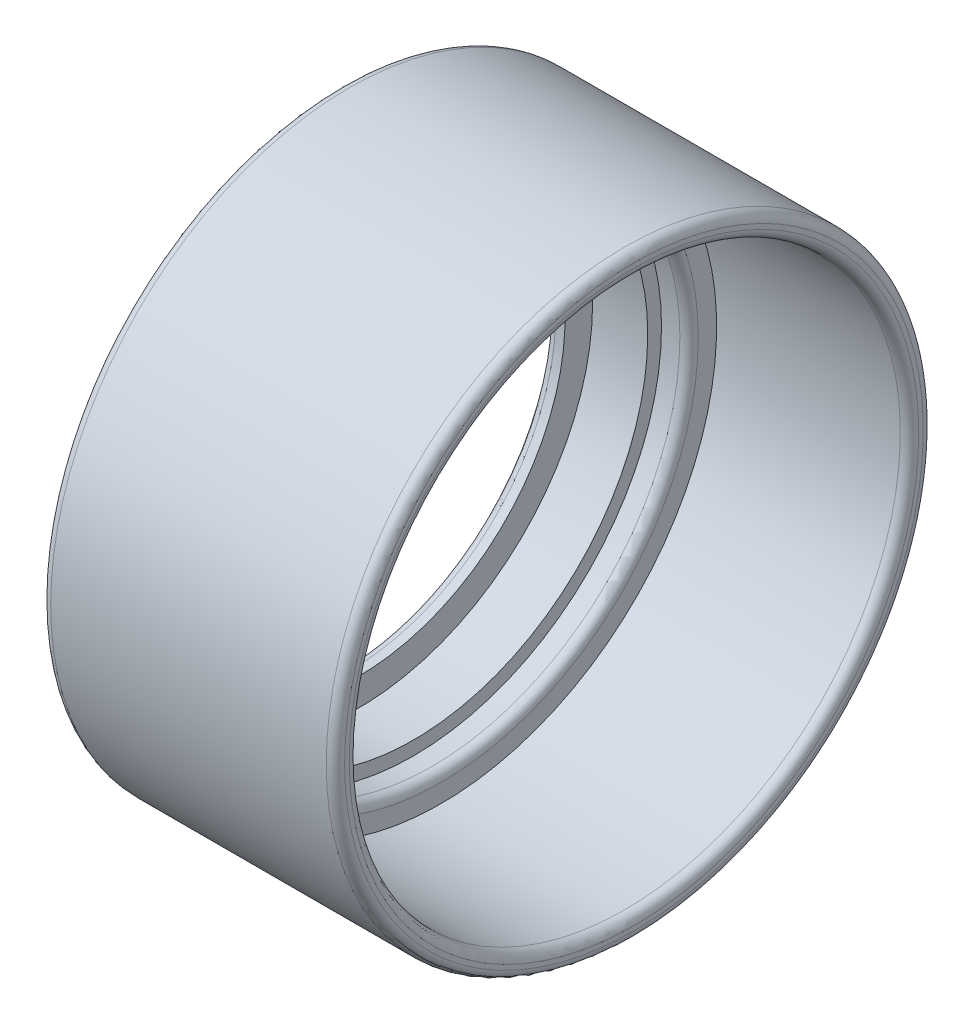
from build123d import *


with BuildPart() as part:
    # Sketch1 → Revolve2 (revolve)
    with BuildSketch(Plane.XY, mode=Mode.PRIVATE) as revolve2_sk:
        with BuildLine():
            Line((1, 22.5), (2, 22.5))
            Line((2, 22.5), (2, 25.5))
            Line((2, 25.5), (8, 25.5))
            Line((8, 25.5), (8, 27))
            Line((8, 27), (10, 27))
            ThreePointArc((10, 27), (10.707106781, 27.292893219), (11, 28))
            Line((11, 28), (11, 30))
            Line((11, 30), (31, 30))
            ThreePointArc((31, 30), (31.707106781, 30.292893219), (32, 31))
            Line((32, 31), (32, 31.5))
            ThreePointArc((32, 31.5), (31.707106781, 32.207106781), (31, 32.5))
            Line((31, 32.5), (1, 32.5))
            ThreePointArc((1, 32.5), (0.292893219, 32.207106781), (0, 31.5))
            Line((0, 31.5), (0, 23.5))
            ThreePointArc((0, 23.5), (0.292893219, 22.792893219), (1, 22.5))
        make_face()
    revolve(revolve2_sk.sketch.rotate(Axis((-93.904460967, 0, 0), (1, 0, 0)), 90), axis=Axis((-93.904460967, 0, 0), (1, 0, 0)))


solid = part.part
